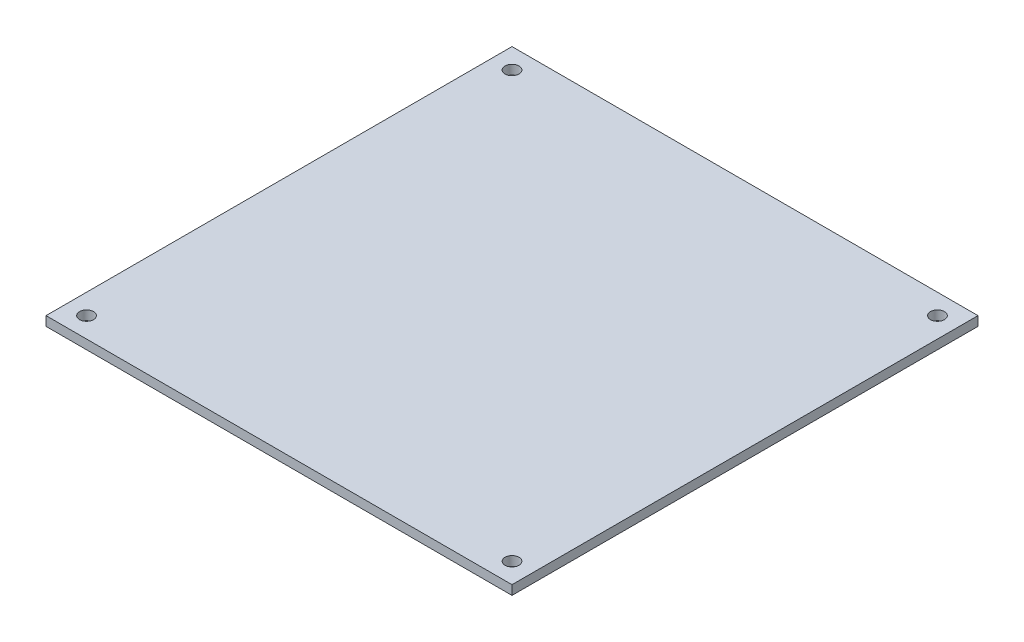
ISO-10303-21;
HEADER;
FILE_DESCRIPTION(('STEP AP214'),'2;1');
FILE_NAME('part.step','',(''),(''),'','','');
FILE_SCHEMA(('AUTOMOTIVE_DESIGN { 1 0 10303 214 1 1 1 1 }'));
ENDSEC;
DATA;
#1=APPLICATION_CONTEXT('core data for automotive mechanical design processes');
#2=APPLICATION_PROTOCOL_DEFINITION('international standard','automotive_design',2000,#1);
#3=PRODUCT_CONTEXT('',#1,'mechanical');
#4=PRODUCT('Part','Part','',(#3));
#5=PRODUCT_RELATED_PRODUCT_CATEGORY('part','',(#4));
#6=PRODUCT_DEFINITION_FORMATION('','',#4);
#7=PRODUCT_DEFINITION_CONTEXT('part definition',#1,'design');
#8=PRODUCT_DEFINITION('design','',#6,#7);
#9=PRODUCT_DEFINITION_SHAPE('','',#8);
#10=(LENGTH_UNIT() NAMED_UNIT(*) SI_UNIT(.MILLI.,.METRE.));
#11=(NAMED_UNIT(*) PLANE_ANGLE_UNIT() SI_UNIT($,.RADIAN.));
#12=(NAMED_UNIT(*) SI_UNIT($,.STERADIAN.) SOLID_ANGLE_UNIT());
#13=UNCERTAINTY_MEASURE_WITH_UNIT(LENGTH_MEASURE(1.E-05),#10,'distance_accuracy_value','');
#14=(GEOMETRIC_REPRESENTATION_CONTEXT(3) GLOBAL_UNCERTAINTY_ASSIGNED_CONTEXT((#13)) GLOBAL_UNIT_ASSIGNED_CONTEXT((#10,
#11,#12)) REPRESENTATION_CONTEXT('',''));
#15=CARTESIAN_POINT('',(0.,0.,0.));
#16=DIRECTION('',(0.,0.,1.));
#17=DIRECTION('',(1.,0.,0.));
#18=AXIS2_PLACEMENT_3D('',#15,#16,#17);
#19=CARTESIAN_POINT('',(0.,2.,0.));
#20=DIRECTION('',(0.,1.,0.));
#21=DIRECTION('',(0.,0.,1.));
#22=AXIS2_PLACEMENT_3D('',#19,#20,#21);
#23=PLANE('',#22);
#24=CARTESIAN_POINT('',(-46.1521158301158,2.,-44.5202393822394));
#25=DIRECTION('',(0.,1.,0.));
#26=DIRECTION('',(0.,0.,1.));
#27=AXIS2_PLACEMENT_3D('',#24,#25,#26);
#28=CIRCLE('',#27,1.5);
#29=CARTESIAN_POINT('',(-46.1521158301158,2.,-43.0202393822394));
#30=VERTEX_POINT('',#29);
#31=EDGE_CURVE('E120',#30,#30,#28,.T.);
#32=ORIENTED_EDGE('',*,*,#31,.F.);
#33=EDGE_LOOP('',(#32));
#34=FACE_BOUND('',#33,.T.);
#35=CARTESIAN_POINT('',(45.1478841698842,2.,46.7797606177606));
#36=DIRECTION('',(0.,1.,0.));
#37=DIRECTION('',(0.,0.,1.));
#38=AXIS2_PLACEMENT_3D('',#35,#36,#37);
#39=CIRCLE('',#38,1.5);
#40=CARTESIAN_POINT('',(45.1478841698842,2.,48.2797606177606));
#41=VERTEX_POINT('',#40);
#42=EDGE_CURVE('E99',#41,#41,#39,.T.);
#43=ORIENTED_EDGE('',*,*,#42,.F.);
#44=EDGE_LOOP('',(#43));
#45=FACE_BOUND('',#44,.T.);
#46=DIRECTION('',(-1.,0.,0.));
#47=VECTOR('',#46,1.);
#48=CARTESIAN_POINT('',(49.4978841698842,2.,-48.8702393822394));
#49=LINE('',#48,#47);
#50=CARTESIAN_POINT('',(49.4978841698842,2.,-48.8702393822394));
#51=VERTEX_POINT('',#50);
#52=CARTESIAN_POINT('',(-50.5021158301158,2.,-48.8702393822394));
#53=VERTEX_POINT('',#52);
#54=EDGE_CURVE('E84',#51,#53,#49,.T.);
#55=ORIENTED_EDGE('',*,*,#54,.T.);
#56=DIRECTION('',(0.,0.,1.));
#57=VECTOR('',#56,1.);
#58=CARTESIAN_POINT('',(-50.5021158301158,2.,-48.8702393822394));
#59=LINE('',#58,#57);
#60=CARTESIAN_POINT('',(-50.5021158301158,2.,51.1297606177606));
#61=VERTEX_POINT('',#60);
#62=EDGE_CURVE('E79',#53,#61,#59,.T.);
#63=ORIENTED_EDGE('',*,*,#62,.T.);
#64=DIRECTION('',(1.,0.,0.));
#65=VECTOR('',#64,1.);
#66=CARTESIAN_POINT('',(-50.5021158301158,2.,51.1297606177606));
#67=LINE('',#66,#65);
#68=CARTESIAN_POINT('',(49.4978841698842,2.,51.1297606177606));
#69=VERTEX_POINT('',#68);
#70=EDGE_CURVE('E82',#61,#69,#67,.T.);
#71=ORIENTED_EDGE('',*,*,#70,.T.);
#72=DIRECTION('',(0.,0.,-1.));
#73=VECTOR('',#72,1.);
#74=CARTESIAN_POINT('',(49.4978841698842,2.,51.1297606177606));
#75=LINE('',#74,#73);
#76=EDGE_CURVE('E49',#69,#51,#75,.T.);
#77=ORIENTED_EDGE('',*,*,#76,.T.);
#78=EDGE_LOOP('',(#55,#63,#71,#77));
#79=FACE_BOUND('',#78,.T.);
#80=CARTESIAN_POINT('',(-46.1521158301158,2.,46.7797606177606));
#81=DIRECTION('',(0.,1.,0.));
#82=DIRECTION('',(0.,0.,1.));
#83=AXIS2_PLACEMENT_3D('',#80,#81,#82);
#84=CIRCLE('',#83,1.5);
#85=CARTESIAN_POINT('',(-46.1521158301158,2.,48.2797606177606));
#86=VERTEX_POINT('',#85);
#87=EDGE_CURVE('E114',#86,#86,#84,.T.);
#88=ORIENTED_EDGE('',*,*,#87,.F.);
#89=EDGE_LOOP('',(#88));
#90=FACE_BOUND('',#89,.T.);
#91=CARTESIAN_POINT('',(45.1478841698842,2.,-44.5202393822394));
#92=DIRECTION('',(0.,1.,0.));
#93=DIRECTION('',(0.,0.,1.));
#94=AXIS2_PLACEMENT_3D('',#91,#92,#93);
#95=CIRCLE('',#94,1.5);
#96=CARTESIAN_POINT('',(45.1478841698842,2.,-43.0202393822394));
#97=VERTEX_POINT('',#96);
#98=EDGE_CURVE('E126',#97,#97,#95,.T.);
#99=ORIENTED_EDGE('',*,*,#98,.F.);
#100=EDGE_LOOP('',(#99));
#101=FACE_BOUND('',#100,.T.);
#102=ADVANCED_FACE('F32',(#34,#45,#79,#90,#101),#23,.T.);
#103=CARTESIAN_POINT('',(0.,0.,0.));
#104=DIRECTION('',(0.,1.,0.));
#105=DIRECTION('',(0.,0.,1.));
#106=AXIS2_PLACEMENT_3D('',#103,#104,#105);
#107=PLANE('',#106);
#108=DIRECTION('',(-1.,0.,0.));
#109=VECTOR('',#108,1.);
#110=CARTESIAN_POINT('',(49.4978841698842,0.,-48.8702393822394));
#111=LINE('',#110,#109);
#112=CARTESIAN_POINT('',(49.4978841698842,0.,-48.8702393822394));
#113=VERTEX_POINT('',#112);
#114=CARTESIAN_POINT('',(-50.5021158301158,0.,-48.8702393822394));
#115=VERTEX_POINT('',#114);
#116=EDGE_CURVE('E96',#113,#115,#111,.T.);
#117=ORIENTED_EDGE('',*,*,#116,.F.);
#118=DIRECTION('',(0.,0.,-1.));
#119=VECTOR('',#118,1.);
#120=CARTESIAN_POINT('',(49.4978841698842,0.,51.1297606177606));
#121=LINE('',#120,#119);
#122=CARTESIAN_POINT('',(49.4978841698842,0.,51.1297606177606));
#123=VERTEX_POINT('',#122);
#124=EDGE_CURVE('E72',#123,#113,#121,.T.);
#125=ORIENTED_EDGE('',*,*,#124,.F.);
#126=DIRECTION('',(1.,0.,0.));
#127=VECTOR('',#126,1.);
#128=CARTESIAN_POINT('',(-50.5021158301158,0.,51.1297606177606));
#129=LINE('',#128,#127);
#130=CARTESIAN_POINT('',(-50.5021158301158,0.,51.1297606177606));
#131=VERTEX_POINT('',#130);
#132=EDGE_CURVE('E66',#131,#123,#129,.T.);
#133=ORIENTED_EDGE('',*,*,#132,.F.);
#134=DIRECTION('',(0.,0.,1.));
#135=VECTOR('',#134,1.);
#136=CARTESIAN_POINT('',(-50.5021158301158,0.,-48.8702393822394));
#137=LINE('',#136,#135);
#138=EDGE_CURVE('E88',#115,#131,#137,.T.);
#139=ORIENTED_EDGE('',*,*,#138,.F.);
#140=EDGE_LOOP('',(#117,#125,#133,#139));
#141=FACE_BOUND('',#140,.T.);
#142=CARTESIAN_POINT('',(45.1478841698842,0.,46.7797606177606));
#143=DIRECTION('',(0.,1.,0.));
#144=DIRECTION('',(0.,0.,1.));
#145=AXIS2_PLACEMENT_3D('',#142,#143,#144);
#146=CIRCLE('',#145,1.5);
#147=CARTESIAN_POINT('',(45.1478841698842,0.,48.2797606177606));
#148=VERTEX_POINT('',#147);
#149=EDGE_CURVE('E111',#148,#148,#146,.T.);
#150=ORIENTED_EDGE('',*,*,#149,.T.);
#151=EDGE_LOOP('',(#150));
#152=FACE_BOUND('',#151,.T.);
#153=CARTESIAN_POINT('',(-46.1521158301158,0.,46.7797606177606));
#154=DIRECTION('',(0.,1.,0.));
#155=DIRECTION('',(0.,0.,1.));
#156=AXIS2_PLACEMENT_3D('',#153,#154,#155);
#157=CIRCLE('',#156,1.5);
#158=CARTESIAN_POINT('',(-46.1521158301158,0.,48.2797606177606));
#159=VERTEX_POINT('',#158);
#160=EDGE_CURVE('E117',#159,#159,#157,.T.);
#161=ORIENTED_EDGE('',*,*,#160,.T.);
#162=EDGE_LOOP('',(#161));
#163=FACE_BOUND('',#162,.T.);
#164=CARTESIAN_POINT('',(-46.1521158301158,0.,-44.5202393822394));
#165=DIRECTION('',(0.,1.,0.));
#166=DIRECTION('',(0.,0.,1.));
#167=AXIS2_PLACEMENT_3D('',#164,#165,#166);
#168=CIRCLE('',#167,1.5);
#169=CARTESIAN_POINT('',(-46.1521158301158,0.,-43.0202393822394));
#170=VERTEX_POINT('',#169);
#171=EDGE_CURVE('E123',#170,#170,#168,.T.);
#172=ORIENTED_EDGE('',*,*,#171,.T.);
#173=EDGE_LOOP('',(#172));
#174=FACE_BOUND('',#173,.T.);
#175=CARTESIAN_POINT('',(45.1478841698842,0.,-44.5202393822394));
#176=DIRECTION('',(0.,1.,0.));
#177=DIRECTION('',(0.,0.,1.));
#178=AXIS2_PLACEMENT_3D('',#175,#176,#177);
#179=CIRCLE('',#178,1.5);
#180=CARTESIAN_POINT('',(45.1478841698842,0.,-43.0202393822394));
#181=VERTEX_POINT('',#180);
#182=EDGE_CURVE('E129',#181,#181,#179,.T.);
#183=ORIENTED_EDGE('',*,*,#182,.T.);
#184=EDGE_LOOP('',(#183));
#185=FACE_BOUND('',#184,.T.);
#186=ADVANCED_FACE('F107',(#141,#152,#163,#174,#185),#107,.F.);
#187=CARTESIAN_POINT('',(49.4978841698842,2.,-48.8702393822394));
#188=DIRECTION('',(0.,0.,1.));
#189=DIRECTION('',(1.,0.,0.));
#190=AXIS2_PLACEMENT_3D('',#187,#188,#189);
#191=PLANE('',#190);
#192=ORIENTED_EDGE('',*,*,#116,.T.);
#193=DIRECTION('',(0.,-1.,0.));
#194=VECTOR('',#193,1.);
#195=CARTESIAN_POINT('',(-50.5021158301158,2.,-48.8702393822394));
#196=LINE('',#195,#194);
#197=EDGE_CURVE('E11',#53,#115,#196,.T.);
#198=ORIENTED_EDGE('',*,*,#197,.F.);
#199=ORIENTED_EDGE('',*,*,#54,.F.);
#200=DIRECTION('',(0.,-1.,0.));
#201=VECTOR('',#200,1.);
#202=CARTESIAN_POINT('',(49.4978841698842,2.,-48.8702393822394));
#203=LINE('',#202,#201);
#204=EDGE_CURVE('E92',#51,#113,#203,.T.);
#205=ORIENTED_EDGE('',*,*,#204,.T.);
#206=EDGE_LOOP('',(#192,#198,#199,#205));
#207=FACE_BOUND('',#206,.T.);
#208=ADVANCED_FACE('F34',(#207),#191,.F.);
#209=CARTESIAN_POINT('',(-50.5021158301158,2.,-48.8702393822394));
#210=DIRECTION('',(1.,0.,0.));
#211=DIRECTION('',(0.,0.,-1.));
#212=AXIS2_PLACEMENT_3D('',#209,#210,#211);
#213=PLANE('',#212);
#214=ORIENTED_EDGE('',*,*,#138,.T.);
#215=DIRECTION('',(0.,-1.,0.));
#216=VECTOR('',#215,1.);
#217=CARTESIAN_POINT('',(-50.5021158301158,2.,51.1297606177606));
#218=LINE('',#217,#216);
#219=EDGE_CURVE('E41',#61,#131,#218,.T.);
#220=ORIENTED_EDGE('',*,*,#219,.F.);
#221=ORIENTED_EDGE('',*,*,#62,.F.);
#222=ORIENTED_EDGE('',*,*,#197,.T.);
#223=EDGE_LOOP('',(#214,#220,#221,#222));
#224=FACE_BOUND('',#223,.T.);
#225=ADVANCED_FACE('F87',(#224),#213,.F.);
#226=CARTESIAN_POINT('',(-50.5021158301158,2.,51.1297606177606));
#227=DIRECTION('',(0.,0.,-1.));
#228=DIRECTION('',(-1.,0.,0.));
#229=AXIS2_PLACEMENT_3D('',#226,#227,#228);
#230=PLANE('',#229);
#231=ORIENTED_EDGE('',*,*,#132,.T.);
#232=DIRECTION('',(0.,-1.,0.));
#233=VECTOR('',#232,1.);
#234=CARTESIAN_POINT('',(49.4978841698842,2.,51.1297606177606));
#235=LINE('',#234,#233);
#236=EDGE_CURVE('E89',#69,#123,#235,.T.);
#237=ORIENTED_EDGE('',*,*,#236,.F.);
#238=ORIENTED_EDGE('',*,*,#70,.F.);
#239=ORIENTED_EDGE('',*,*,#219,.T.);
#240=EDGE_LOOP('',(#231,#237,#238,#239));
#241=FACE_BOUND('',#240,.T.);
#242=ADVANCED_FACE('F90',(#241),#230,.F.);
#243=CARTESIAN_POINT('',(49.4978841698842,2.,51.1297606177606));
#244=DIRECTION('',(-1.,0.,0.));
#245=DIRECTION('',(0.,0.,1.));
#246=AXIS2_PLACEMENT_3D('',#243,#244,#245);
#247=PLANE('',#246);
#248=ORIENTED_EDGE('',*,*,#124,.T.);
#249=ORIENTED_EDGE('',*,*,#204,.F.);
#250=ORIENTED_EDGE('',*,*,#76,.F.);
#251=ORIENTED_EDGE('',*,*,#236,.T.);
#252=EDGE_LOOP('',(#248,#249,#250,#251));
#253=FACE_BOUND('',#252,.T.);
#254=ADVANCED_FACE('F104',(#253),#247,.F.);
#255=CARTESIAN_POINT('',(45.1478841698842,2.,46.7797606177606));
#256=DIRECTION('',(0.,-1.,0.));
#257=DIRECTION('',(0.,0.,-1.));
#258=AXIS2_PLACEMENT_3D('',#255,#256,#257);
#259=CYLINDRICAL_SURFACE('',#258,1.5);
#260=ORIENTED_EDGE('',*,*,#42,.T.);
#261=EDGE_LOOP('',(#260));
#262=FACE_BOUND('',#261,.T.);
#263=ORIENTED_EDGE('',*,*,#149,.F.);
#264=EDGE_LOOP('',(#263));
#265=FACE_BOUND('',#264,.T.);
#266=ADVANCED_FACE('F148',(#262,#265),#259,.F.);
#267=CARTESIAN_POINT('',(-46.1521158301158,2.,46.7797606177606));
#268=DIRECTION('',(0.,-1.,0.));
#269=DIRECTION('',(0.,0.,-1.));
#270=AXIS2_PLACEMENT_3D('',#267,#268,#269);
#271=CYLINDRICAL_SURFACE('',#270,1.5);
#272=ORIENTED_EDGE('',*,*,#87,.T.);
#273=EDGE_LOOP('',(#272));
#274=FACE_BOUND('',#273,.T.);
#275=ORIENTED_EDGE('',*,*,#160,.F.);
#276=EDGE_LOOP('',(#275));
#277=FACE_BOUND('',#276,.T.);
#278=ADVANCED_FACE('F194',(#274,#277),#271,.F.);
#279=CARTESIAN_POINT('',(-46.1521158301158,2.,-44.5202393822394));
#280=DIRECTION('',(0.,-1.,0.));
#281=DIRECTION('',(0.,0.,-1.));
#282=AXIS2_PLACEMENT_3D('',#279,#280,#281);
#283=CYLINDRICAL_SURFACE('',#282,1.5);
#284=ORIENTED_EDGE('',*,*,#31,.T.);
#285=EDGE_LOOP('',(#284));
#286=FACE_BOUND('',#285,.T.);
#287=ORIENTED_EDGE('',*,*,#171,.F.);
#288=EDGE_LOOP('',(#287));
#289=FACE_BOUND('',#288,.T.);
#290=ADVANCED_FACE('F202',(#286,#289),#283,.F.);
#291=CARTESIAN_POINT('',(45.1478841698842,2.,-44.5202393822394));
#292=DIRECTION('',(0.,-1.,0.));
#293=DIRECTION('',(0.,0.,-1.));
#294=AXIS2_PLACEMENT_3D('',#291,#292,#293);
#295=CYLINDRICAL_SURFACE('',#294,1.5);
#296=ORIENTED_EDGE('',*,*,#98,.T.);
#297=EDGE_LOOP('',(#296));
#298=FACE_BOUND('',#297,.T.);
#299=ORIENTED_EDGE('',*,*,#182,.F.);
#300=EDGE_LOOP('',(#299));
#301=FACE_BOUND('',#300,.T.);
#302=ADVANCED_FACE('F135',(#298,#301),#295,.F.);
#303=CLOSED_SHELL('',(#102,#186,#208,#225,#242,#254,#266,#278,#290,#302));
#304=MANIFOLD_SOLID_BREP('B2',#303);
#305=ADVANCED_BREP_SHAPE_REPRESENTATION('',(#18,#304),#14);
#306=SHAPE_DEFINITION_REPRESENTATION(#9,#305);
ENDSEC;
END-ISO-10303-21;
